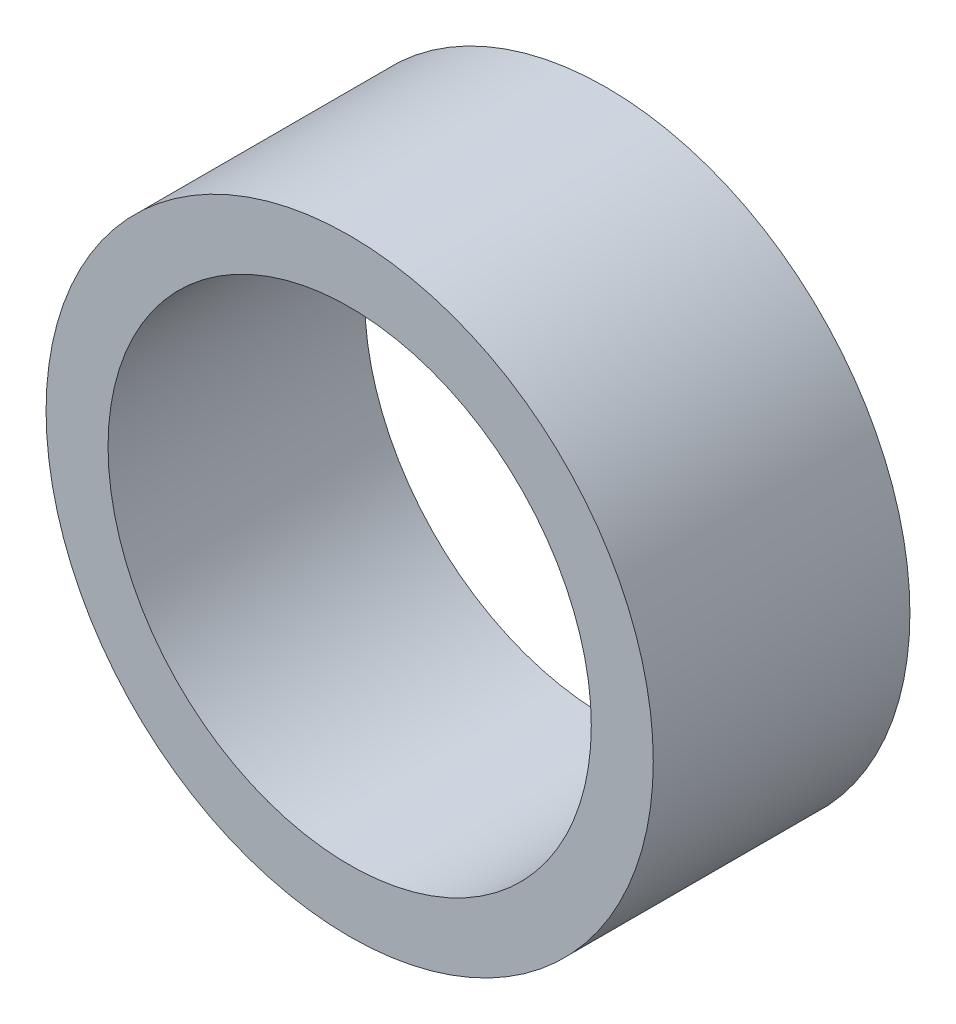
ISO-10303-21;
HEADER;
FILE_DESCRIPTION(('STEP AP214'),'2;1');
FILE_NAME('part.step','',(''),(''),'','','');
FILE_SCHEMA(('AUTOMOTIVE_DESIGN { 1 0 10303 214 1 1 1 1 }'));
ENDSEC;
DATA;
#1=APPLICATION_CONTEXT('core data for automotive mechanical design processes');
#2=APPLICATION_PROTOCOL_DEFINITION('international standard','automotive_design',2000,#1);
#3=PRODUCT_CONTEXT('',#1,'mechanical');
#4=PRODUCT('Part','Part','',(#3));
#5=PRODUCT_RELATED_PRODUCT_CATEGORY('part','',(#4));
#6=PRODUCT_DEFINITION_FORMATION('','',#4);
#7=PRODUCT_DEFINITION_CONTEXT('part definition',#1,'design');
#8=PRODUCT_DEFINITION('design','',#6,#7);
#9=PRODUCT_DEFINITION_SHAPE('','',#8);
#10=(LENGTH_UNIT() NAMED_UNIT(*) SI_UNIT(.MILLI.,.METRE.));
#11=(NAMED_UNIT(*) PLANE_ANGLE_UNIT() SI_UNIT($,.RADIAN.));
#12=(NAMED_UNIT(*) SI_UNIT($,.STERADIAN.) SOLID_ANGLE_UNIT());
#13=UNCERTAINTY_MEASURE_WITH_UNIT(LENGTH_MEASURE(1.E-05),#10,'distance_accuracy_value','');
#14=(GEOMETRIC_REPRESENTATION_CONTEXT(3) GLOBAL_UNCERTAINTY_ASSIGNED_CONTEXT((#13)) GLOBAL_UNIT_ASSIGNED_CONTEXT((#10,
#11,#12)) REPRESENTATION_CONTEXT('',''));
#15=CARTESIAN_POINT('',(0.,0.,0.));
#16=DIRECTION('',(0.,0.,1.));
#17=DIRECTION('',(1.,0.,0.));
#18=AXIS2_PLACEMENT_3D('',#15,#16,#17);
#19=CARTESIAN_POINT('',(1.16840000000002,0.,5.20699999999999));
#20=DIRECTION('',(0.,0.,-1.));
#21=DIRECTION('',(-1.,0.,0.));
#22=AXIS2_PLACEMENT_3D('',#19,#20,#21);
#23=CYLINDRICAL_SURFACE('',#22,6.1595);
#24=CARTESIAN_POINT('',(1.16840000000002,0.,5.20699999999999));
#25=DIRECTION('',(0.,0.,1.));
#26=DIRECTION('',(1.,0.,0.));
#27=AXIS2_PLACEMENT_3D('',#24,#25,#26);
#28=CIRCLE('',#27,6.1595);
#29=CARTESIAN_POINT('',(7.32790000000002,0.,5.20699999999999));
#30=VERTEX_POINT('',#29);
#31=EDGE_CURVE('E10',#30,#30,#28,.T.);
#32=ORIENTED_EDGE('',*,*,#31,.F.);
#33=EDGE_LOOP('',(#32));
#34=FACE_BOUND('',#33,.T.);
#35=CARTESIAN_POINT('',(1.16840000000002,0.,0.));
#36=DIRECTION('',(0.,0.,1.));
#37=DIRECTION('',(1.,0.,0.));
#38=AXIS2_PLACEMENT_3D('',#35,#36,#37);
#39=CIRCLE('',#38,6.1595);
#40=CARTESIAN_POINT('',(7.32790000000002,0.,0.));
#41=VERTEX_POINT('',#40);
#42=EDGE_CURVE('E31',#41,#41,#39,.T.);
#43=ORIENTED_EDGE('',*,*,#42,.T.);
#44=EDGE_LOOP('',(#43));
#45=FACE_BOUND('',#44,.T.);
#46=ADVANCED_FACE('F28',(#34,#45),#23,.T.);
#47=CARTESIAN_POINT('',(1.16840000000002,0.,5.20699999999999));
#48=DIRECTION('',(0.,0.,1.));
#49=DIRECTION('',(1.,0.,0.));
#50=AXIS2_PLACEMENT_3D('',#47,#48,#49);
#51=PLANE('',#50);
#52=CARTESIAN_POINT('',(1.16840000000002,0.,5.20699999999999));
#53=DIRECTION('',(0.,0.,-1.));
#54=DIRECTION('',(-1.,0.,0.));
#55=AXIS2_PLACEMENT_3D('',#52,#53,#54);
#56=CIRCLE('',#55,4.9022);
#57=CARTESIAN_POINT('',(-3.73379999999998,0.,5.20699999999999));
#58=VERTEX_POINT('',#57);
#59=EDGE_CURVE('E38',#58,#58,#56,.T.);
#60=ORIENTED_EDGE('',*,*,#59,.T.);
#61=EDGE_LOOP('',(#60));
#62=FACE_BOUND('',#61,.T.);
#63=ORIENTED_EDGE('',*,*,#31,.T.);
#64=EDGE_LOOP('',(#63));
#65=FACE_BOUND('',#64,.T.);
#66=ADVANCED_FACE('F46',(#62,#65),#51,.T.);
#67=CARTESIAN_POINT('',(1.16840000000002,0.,0.));
#68=DIRECTION('',(0.,0.,1.));
#69=DIRECTION('',(1.,0.,0.));
#70=AXIS2_PLACEMENT_3D('',#67,#68,#69);
#71=PLANE('',#70);
#72=CARTESIAN_POINT('',(1.16840000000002,0.,0.));
#73=DIRECTION('',(0.,0.,-1.));
#74=DIRECTION('',(-1.,0.,0.));
#75=AXIS2_PLACEMENT_3D('',#72,#73,#74);
#76=CIRCLE('',#75,4.9022);
#77=CARTESIAN_POINT('',(-3.73379999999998,0.,0.));
#78=VERTEX_POINT('',#77);
#79=EDGE_CURVE('E40',#78,#78,#76,.T.);
#80=ORIENTED_EDGE('',*,*,#79,.F.);
#81=EDGE_LOOP('',(#80));
#82=FACE_BOUND('',#81,.T.);
#83=ORIENTED_EDGE('',*,*,#42,.F.);
#84=EDGE_LOOP('',(#83));
#85=FACE_BOUND('',#84,.T.);
#86=ADVANCED_FACE('F51',(#82,#85),#71,.F.);
#87=CARTESIAN_POINT('',(1.16840000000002,0.,5.20699999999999));
#88=DIRECTION('',(0.,0.,-1.));
#89=DIRECTION('',(-1.,0.,0.));
#90=AXIS2_PLACEMENT_3D('',#87,#88,#89);
#91=CYLINDRICAL_SURFACE('',#90,4.9022);
#92=ORIENTED_EDGE('',*,*,#59,.F.);
#93=EDGE_LOOP('',(#92));
#94=FACE_BOUND('',#93,.T.);
#95=ORIENTED_EDGE('',*,*,#79,.T.);
#96=EDGE_LOOP('',(#95));
#97=FACE_BOUND('',#96,.T.);
#98=ADVANCED_FACE('F48',(#94,#97),#91,.F.);
#99=CLOSED_SHELL('',(#46,#66,#86,#98));
#100=MANIFOLD_SOLID_BREP('B2',#99);
#101=ADVANCED_BREP_SHAPE_REPRESENTATION('',(#18,#100),#14);
#102=SHAPE_DEFINITION_REPRESENTATION(#9,#101);
ENDSEC;
END-ISO-10303-21;
